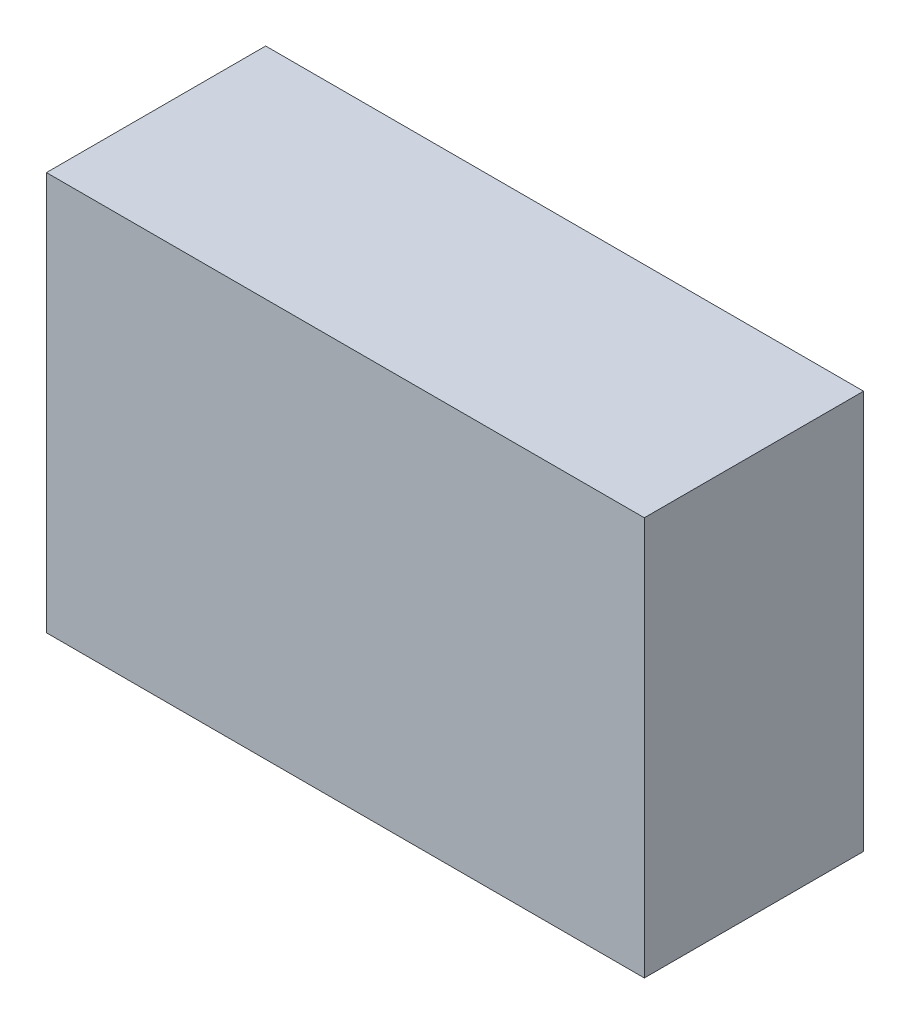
from build123d import *

# Parameters (mm, degrees)
SKICA1_W                = 150
SKICA1_H                = 100
P_IDAT_VYSUNUT_M1_DEPTH = 55


with BuildPart() as part:
    # Skica1 → P_idat vysunut_m1 (new body)
    with BuildSketch(Plane.XY):
        with Locations((75, 50)):
            Rectangle(SKICA1_W, SKICA1_H)
    extrude(amount=P_IDAT_VYSUNUT_M1_DEPTH)


solid = part.part
